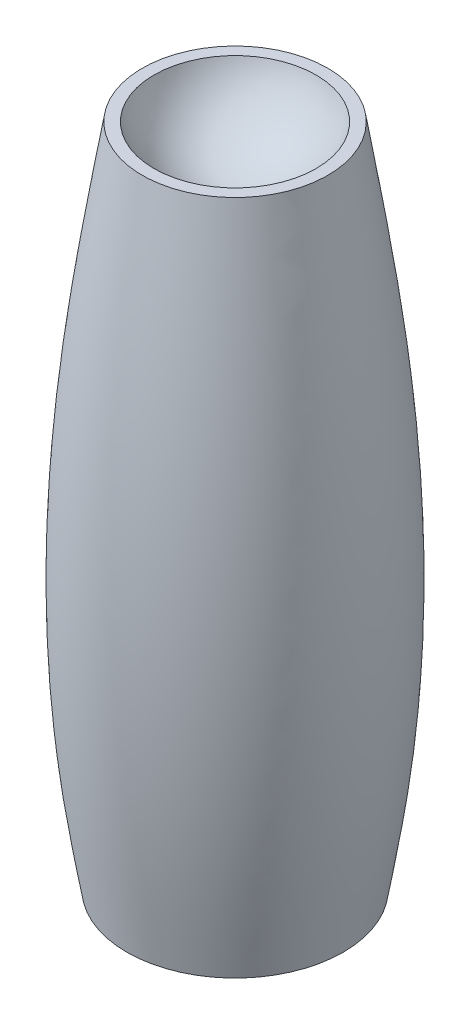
ISO-10303-21;
HEADER;
FILE_DESCRIPTION(('STEP AP214'),'2;1');
FILE_NAME('part.step','',(''),(''),'','','');
FILE_SCHEMA(('AUTOMOTIVE_DESIGN { 1 0 10303 214 1 1 1 1 }'));
ENDSEC;
DATA;
#1=APPLICATION_CONTEXT('core data for automotive mechanical design processes');
#2=APPLICATION_PROTOCOL_DEFINITION('international standard','automotive_design',2000,#1);
#3=PRODUCT_CONTEXT('',#1,'mechanical');
#4=PRODUCT('Part','Part','',(#3));
#5=PRODUCT_RELATED_PRODUCT_CATEGORY('part','',(#4));
#6=PRODUCT_DEFINITION_FORMATION('','',#4);
#7=PRODUCT_DEFINITION_CONTEXT('part definition',#1,'design');
#8=PRODUCT_DEFINITION('design','',#6,#7);
#9=PRODUCT_DEFINITION_SHAPE('','',#8);
#10=(LENGTH_UNIT() NAMED_UNIT(*) SI_UNIT(.MILLI.,.METRE.));
#11=(NAMED_UNIT(*) PLANE_ANGLE_UNIT() SI_UNIT($,.RADIAN.));
#12=(NAMED_UNIT(*) SI_UNIT($,.STERADIAN.) SOLID_ANGLE_UNIT());
#13=UNCERTAINTY_MEASURE_WITH_UNIT(LENGTH_MEASURE(1.E-05),#10,'distance_accuracy_value','');
#14=(GEOMETRIC_REPRESENTATION_CONTEXT(3) GLOBAL_UNCERTAINTY_ASSIGNED_CONTEXT((#13)) GLOBAL_UNIT_ASSIGNED_CONTEXT((#10,
#11,#12)) REPRESENTATION_CONTEXT('',''));
#15=CARTESIAN_POINT('',(0.,0.,0.));
#16=DIRECTION('',(0.,0.,1.));
#17=DIRECTION('',(1.,0.,0.));
#18=AXIS2_PLACEMENT_3D('',#15,#16,#17);
#19=CARTESIAN_POINT('',(0.,258.,0.));
#20=DIRECTION('',(0.,-1.,0.));
#21=DIRECTION('',(0.,0.,-1.));
#22=AXIS2_PLACEMENT_3D('',#19,#20,#21);
#23=PLANE('',#22);
#24=CARTESIAN_POINT('',(0.,258.,0.));
#25=DIRECTION('',(0.,-1.,0.));
#26=DIRECTION('',(0.,0.,-1.));
#27=AXIS2_PLACEMENT_3D('',#24,#25,#26);
#28=CIRCLE('',#27,31.4483703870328);
#29=CARTESIAN_POINT('',(0.,258.,-31.4483703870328));
#30=VERTEX_POINT('',#29);
#31=EDGE_CURVE('E37',#30,#30,#28,.T.);
#32=ORIENTED_EDGE('',*,*,#31,.T.);
#33=EDGE_LOOP('',(#32));
#34=FACE_BOUND('',#33,.T.);
#35=CARTESIAN_POINT('',(0.,258.,0.));
#36=DIRECTION('',(0.,-1.,0.));
#37=DIRECTION('',(0.,0.,-1.));
#38=AXIS2_PLACEMENT_3D('',#35,#36,#37);
#39=CIRCLE('',#38,36.);
#40=CARTESIAN_POINT('',(0.,258.,-36.));
#41=VERTEX_POINT('',#40);
#42=EDGE_CURVE('E10',#41,#41,#39,.T.);
#43=ORIENTED_EDGE('',*,*,#42,.F.);
#44=EDGE_LOOP('',(#43));
#45=FACE_BOUND('',#44,.T.);
#46=ADVANCED_FACE('F34',(#34,#45),#23,.F.);
#47=CARTESIAN_POINT('',(-36.,258.,0.));
#48=CARTESIAN_POINT('',(-40.2237926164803,232.287374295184,0.));
#49=CARTESIAN_POINT('',(-52.3577357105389,158.421167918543,0.));
#50=CARTESIAN_POINT('',(-54.0358189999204,70.8686720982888,0.));
#51=CARTESIAN_POINT('',(-43.9294639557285,11.3609674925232,0.));
#52=CARTESIAN_POINT('',(-42.,0.,0.));
#53=B_SPLINE_CURVE_WITH_KNOTS('',3,(#47,#48,#49,#50,#51,#52),.UNSPECIFIED.,.F.,.F.,(4,1,1,4),
(0.,0.301689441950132,0.866681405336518,1.),.UNSPECIFIED.);
#54=CARTESIAN_POINT('',(0.,0.,0.));
#55=DIRECTION('',(0.,-1.,0.));
#56=AXIS1_PLACEMENT('',#54,#55);
#57=SURFACE_OF_REVOLUTION('',#53,#56);
#58=CARTESIAN_POINT('',(0.,0.,0.));
#59=DIRECTION('',(0.,-1.,0.));
#60=DIRECTION('',(0.,0.,-1.));
#61=AXIS2_PLACEMENT_3D('',#58,#59,#60);
#62=CIRCLE('',#61,42.);
#63=CARTESIAN_POINT('',(0.,0.,-42.));
#64=VERTEX_POINT('',#63);
#65=EDGE_CURVE('E41',#64,#64,#62,.T.);
#66=ORIENTED_EDGE('',*,*,#65,.F.);
#67=EDGE_LOOP('',(#66));
#68=FACE_BOUND('',#67,.T.);
#69=ORIENTED_EDGE('',*,*,#42,.T.);
#70=EDGE_LOOP('',(#69));
#71=FACE_BOUND('',#70,.T.);
#72=ADVANCED_FACE('F68',(#68,#71),#57,.T.);
#73=CARTESIAN_POINT('',(0.,0.,0.));
#74=DIRECTION('',(0.,1.,0.));
#75=DIRECTION('',(0.,0.,1.));
#76=AXIS2_PLACEMENT_3D('',#73,#74,#75);
#77=PLANE('',#76);
#78=CARTESIAN_POINT('',(0.,0.,0.));
#79=DIRECTION('',(0.,1.,0.));
#80=DIRECTION('',(0.,0.,1.));
#81=AXIS2_PLACEMENT_3D('',#78,#79,#80);
#82=CIRCLE('',#81,37.4699879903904);
#83=CARTESIAN_POINT('',(0.,0.,37.4699879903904));
#84=VERTEX_POINT('',#83);
#85=EDGE_CURVE('E46',#84,#84,#82,.T.);
#86=ORIENTED_EDGE('',*,*,#85,.T.);
#87=EDGE_LOOP('',(#86));
#88=FACE_BOUND('',#87,.T.);
#89=ORIENTED_EDGE('',*,*,#65,.T.);
#90=EDGE_LOOP('',(#89));
#91=FACE_BOUND('',#90,.T.);
#92=ADVANCED_FACE('F64',(#88,#91),#77,.F.);
#93=CARTESIAN_POINT('',(0.,-30.,0.));
#94=DIRECTION('',(0.,-1.,0.));
#95=DIRECTION('',(-1.,0.,0.));
#96=AXIS2_PLACEMENT_3D('',#93,#94,#95);
#97=SPHERICAL_SURFACE('',#96,48.);
#98=ORIENTED_EDGE('',*,*,#85,.F.);
#99=EDGE_LOOP('',(#98));
#100=FACE_BOUND('',#99,.T.);
#101=ADVANCED_FACE('F59',(#100),#97,.F.);
#102=CARTESIAN_POINT('',(0.,268.,0.));
#103=DIRECTION('',(0.,-1.,0.));
#104=DIRECTION('',(-1.,0.,0.));
#105=AXIS2_PLACEMENT_3D('',#102,#103,#104);
#106=SPHERICAL_SURFACE('',#105,33.);
#107=ORIENTED_EDGE('',*,*,#31,.F.);
#108=EDGE_LOOP('',(#107));
#109=FACE_BOUND('',#108,.T.);
#110=ADVANCED_FACE('F57',(#109),#106,.F.);
#111=CLOSED_SHELL('',(#46,#72,#92,#101,#110));
#112=MANIFOLD_SOLID_BREP('B2',#111);
#113=ADVANCED_BREP_SHAPE_REPRESENTATION('',(#18,#112),#14);
#114=SHAPE_DEFINITION_REPRESENTATION(#9,#113);
ENDSEC;
END-ISO-10303-21;
